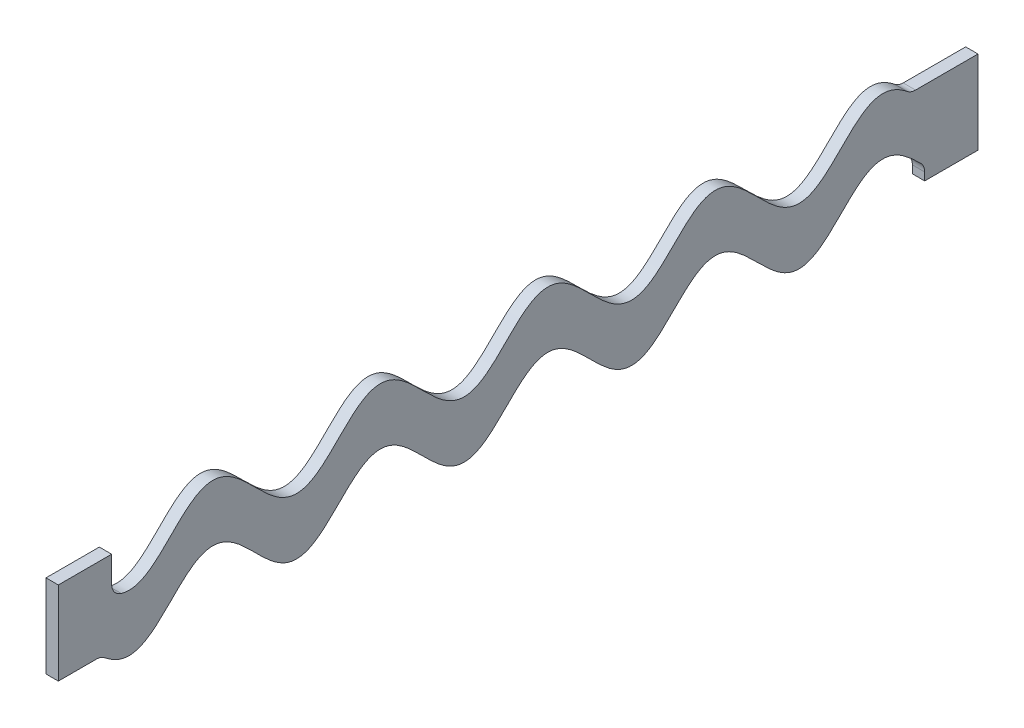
from build123d import *

# Parameters (mm, degrees)
SKETCH1_W           = 11.74
SKETCH1_H           = 79.375
BOSS_EXTRUDE1_DEPTH = 50.8
BOSS_EXTRUDE2_DEPTH = 11.74
BOSS_EXTRUDE3_REACH = 837.783
SKETCH6_W           = 11.74
SKETCH6_H           = 12.699929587
FILLET2_R           = 12.7


with BuildPart() as part:
    # Sketch1 → Boss-Extrude1 (new body)
    with BuildSketch(Plane.XY):
        with Locations((-5.87, 77.7875)):
            Rectangle(SKETCH1_W, SKETCH1_H)
    extrude(amount=BOSS_EXTRUDE1_DEPTH)

    # Sketch5 → Boss-Extrude2 (add)
    with BuildSketch(Plane.ZY.offset(11.74)):
        with BuildLine():
            Line((876.3, 117.475), (825.5, 117.475))
            Line((825.5, 117.475), (825.5, 84.629620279))
            add(Edge.make_bspline(
                [(50.800000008, 104.775070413), (51.355453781, 105.330524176), (52.470739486, 106.445803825), (54.365860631, 108.336036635), (56.616573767, 110.550459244), (59.045730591, 112.892625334), (61.427049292, 115.113600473), (63.902216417, 117.329610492), (66.410789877, 119.451736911), (69.053050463, 121.536346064), (71.826001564, 123.530133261), (75.346070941, 125.770952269), (79.301668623, 127.811126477), (83.703468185, 129.406198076), (88.524231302, 130.24115258), (92.937197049, 130.235262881), (97.7676673, 129.385824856), (103.00209859, 127.47578622), (109.779465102, 123.683414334), (117.601440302, 117.516681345), (125.997244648, 109.47364202), (135.195677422, 100.076514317), (143.591417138, 92.033403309), (151.413529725, 85.866822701), (158.190680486, 82.074211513), (163.425465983, 80.164565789), (168.255320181, 79.314444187), (172.669373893, 79.309762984), (177.488188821, 80.142546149), (182.729025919, 82.044450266), (188.063748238, 85.011131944), (193.461330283, 88.931686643), (198.549751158, 93.266779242), (203.407682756, 97.828676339), (206.848453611, 101.230691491), (209.883578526, 104.265888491), (212.097538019, 106.479409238), (214.39751836, 108.773755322), (217.860398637, 112.170969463), (221.982596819, 116.049452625), (227.084353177, 120.428873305), (232.510271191, 124.408143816), (237.942152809, 127.468963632), (243.301878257, 129.411354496), (248.129375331, 130.238527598), (252.534728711, 130.232696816), (257.369068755, 129.387469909), (261.848338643, 127.748907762), (265.941022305, 125.60724196), (271.571644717, 121.958454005), (278.040319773, 116.709085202), (285.685101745, 109.372673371), (294.693643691, 100.177334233), (303.015371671, 92.191742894), (310.807721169, 86.002047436), (317.644985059, 82.124404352), (323.00957917, 80.163040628), (327.844031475, 79.317234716), (332.249322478, 79.31172565), (337.076856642, 80.138707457), (342.436557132, 82.081227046), (347.868456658, 85.1419545), (353.294362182, 89.121289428), (358.396127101, 93.500665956), (362.518319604, 97.37917841), (365.981203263, 100.7763751), (368.842988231, 103.631173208), (371.128638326, 105.91896545), (373.990425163, 108.773753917), (377.453305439, 112.170968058), (381.575503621, 116.049451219), (386.677259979, 120.4288719), (392.103177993, 124.40814241), (397.535059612, 127.468962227), (402.894785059, 129.411353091), (407.722282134, 130.238526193), (412.127635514, 130.23269541), (416.961975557, 129.387468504), (421.441245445, 127.748906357), (425.533929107, 125.607240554), (431.164551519, 121.9584526), (437.633226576, 116.709083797), (445.278008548, 109.372671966), (454.286550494, 100.177332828), (462.608278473, 92.191741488), (470.400627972, 86.00204603), (477.237891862, 82.124402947), (482.602485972, 80.163039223), (487.436938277, 79.317233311), (491.842229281, 79.311724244), (496.669763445, 80.138706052), (502.029463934, 82.08122564), (507.461363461, 85.141953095), (512.887268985, 89.121288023), (517.989033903, 93.500664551), (522.111226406, 97.379177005), (525.574110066, 100.776373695), (528.435895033, 103.631171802), (530.721545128, 105.918964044), (533.583331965, 108.773752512), (537.046212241, 112.170966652), (541.168410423, 116.049449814), (546.270166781, 120.428870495), (551.696084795, 124.408141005), (557.127966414, 127.468960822), (562.487691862, 129.411351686), (567.315188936, 130.238524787), (571.720542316, 130.232694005), (576.554882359, 129.387467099), (581.034152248, 127.748904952), (585.126835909, 125.607239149), (590.757458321, 121.958451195), (597.226133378, 116.709082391), (604.87091535, 109.37267056), (613.879457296, 100.177331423), (622.201185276, 92.191740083), (629.993534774, 86.002044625), (636.830798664, 82.124401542), (642.195392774, 80.163037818), (647.029845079, 79.317231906), (651.435136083, 79.311722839), (656.262670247, 80.138704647), (661.622370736, 82.081224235), (667.054270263, 85.14195169), (672.480175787, 89.121286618), (677.581940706, 93.500663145), (681.704133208, 97.3791756), (685.167016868, 100.77637229), (687.466142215, 103.069928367), (688.8997198, 104.503062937), (691.823964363, 107.427440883), (694.40898947, 109.995830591), (698.005677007, 113.468910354), (701.979614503, 117.112401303), (706.492404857, 120.907591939), (711.124401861, 124.259804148), (715.966949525, 127.024545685), (721.078126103, 129.104123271), (726.423393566, 130.32939185), (733.021139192, 130.298984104), (739.96750141, 128.233444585), (746.347060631, 124.763168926), (752.864458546, 120.008215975), (759.165106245, 114.472772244), (765.692101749, 108.093410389), (772.628892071, 101.069699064), (779.141205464, 94.730218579), (785.409382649, 89.272087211), (791.020076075, 85.227333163), (795.824009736, 82.498303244), (800.906377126, 80.437186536), (806.23689434, 79.220467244), (811.736634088, 79.247728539), (817.055642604, 80.510425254), (821.119405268, 82.191017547), (823.547389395, 83.470662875), (824.987950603, 84.317723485), (825.5, 84.629620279)],
                knots=[0.009470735, 0.009470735, 0.009470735, 0.009470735, 0.009470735, 0.012708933, 0.015947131, 0.019185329, 0.022423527, 0.025661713, 0.028899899, 0.032138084, 0.03537627, 0.038848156, 0.042320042, 0.048507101, 0.052824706, 0.057142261, 0.061445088, 0.065747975, 0.071996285, 0.078918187, 0.091826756, 0.104735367, 0.117643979, 0.130552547, 0.13747445, 0.14372276, 0.148025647, 0.152328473, 0.156646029, 0.160963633, 0.167150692, 0.174094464, 0.180570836, 0.187047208, 0.193523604, 0.2, 0.2, 0.203332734, 0.206665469, 0.213330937, 0.219996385, 0.226661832, 0.234365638, 0.241031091, 0.245597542, 0.250041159, 0.254463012, 0.259101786, 0.265734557, 0.269601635, 0.273468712, 0.286734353, 0.3, 0.313265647, 0.326531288, 0.334265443, 0.340898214, 0.345536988, 0.349958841, 0.354402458, 0.358968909, 0.365634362, 0.373338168, 0.380003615, 0.386669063, 0.393334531, 0.396667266, 0.4, 0.403332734, 0.406665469, 0.413330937, 0.419996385, 0.426661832, 0.434365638, 0.441031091, 0.445597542, 0.450041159, 0.454463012, 0.459101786, 0.465734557, 0.469601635, 0.473468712, 0.486734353, 0.5, 0.513265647, 0.526531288, 0.534265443, 0.540898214, 0.545536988, 0.549958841, 0.554402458, 0.558968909, 0.565634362, 0.573338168, 0.580003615, 0.586669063, 0.593334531, 0.596667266, 0.6, 0.603332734, 0.606665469, 0.613330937, 0.619996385, 0.626661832, 0.634365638, 0.641031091, 0.645597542, 0.650041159, 0.654463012, 0.659101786, 0.665734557, 0.669601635, 0.673468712, 0.686734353, 0.7, 0.713265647, 0.726531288, 0.734265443, 0.740898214, 0.745536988, 0.749958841, 0.754402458, 0.758968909, 0.765634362, 0.773338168, 0.780003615, 0.786669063, 0.793334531, 0.796667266, 0.8, 0.8, 0.803242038, 0.806484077, 0.809726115, 0.812968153, 0.817424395, 0.821880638, 0.824701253, 0.827521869, 0.83184449, 0.836153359, 0.84176498, 0.846274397, 0.850783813, 0.857247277, 0.86371074, 0.870174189, 0.876637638, 0.881046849, 0.885456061, 0.88826188, 0.891067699, 0.895376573, 0.899685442, 0.902491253, 0.905297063, 0.906867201, 0.906867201, 0.906867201, 0.906867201, 0.906867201], degree=4))
            Line((50.800000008, 104.775070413), (50.8, 117.475))
            Line((50.8, 117.475), (0, 117.475))
            Line((0, 117.475), (0, 38.1))
            Line((0, 38.1), (50.8, 38.1))
            Line((50.8, 38.1), (50.800000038, 50.799657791))
            add(Edge.make_bspline(
                [(50.800000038, 50.799657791), (51.355453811, 51.355111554), (52.470739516, 52.470391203), (54.365860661, 54.360624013), (56.616573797, 56.575046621), (59.045730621, 58.917212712), (61.427049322, 61.138187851), (63.902216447, 63.35419787), (66.410789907, 65.476324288), (69.053050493, 67.560933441), (71.826001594, 69.554720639), (75.346070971, 71.795539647), (79.301668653, 73.835713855), (83.703468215, 75.430785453), (88.524231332, 76.265739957), (92.937197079, 76.259850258), (97.76766733, 75.410412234), (103.00209862, 73.500373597), (109.779465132, 69.708001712), (117.601440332, 63.541268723), (125.997244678, 55.498229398), (135.195677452, 46.101101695), (143.591417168, 38.057990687), (151.413529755, 31.891410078), (158.190680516, 28.098798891), (163.425466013, 26.189153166), (168.255320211, 25.339031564), (172.669373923, 25.334350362), (177.488188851, 26.167133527), (182.729025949, 28.069037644), (188.063748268, 31.035719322), (193.461330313, 34.956274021), (198.549751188, 39.29136662), (203.407682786, 43.853263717), (206.848453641, 47.255278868), (209.883578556, 50.290475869), (212.097538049, 52.503996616), (214.39751839, 54.7983427), (217.860398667, 58.195556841), (221.982596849, 62.074040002), (227.084353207, 66.453460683), (232.510271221, 70.432731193), (237.942152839, 73.49355101), (243.301878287, 75.435941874), (248.129375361, 76.263114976), (252.534728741, 76.257284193), (257.369068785, 75.412057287), (261.848338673, 73.77349514), (265.941022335, 71.631829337), (271.571644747, 67.983041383), (278.040319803, 62.73367258), (285.685101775, 55.397260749), (294.693643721, 46.201921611), (303.015371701, 38.216330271), (310.807721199, 32.026634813), (317.644985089, 28.14899173), (323.0095792, 26.187628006), (327.844031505, 25.341822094), (332.249322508, 25.336313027), (337.076856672, 26.163294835), (342.436557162, 28.105814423), (347.868456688, 31.166541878), (353.294362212, 35.145876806), (358.396127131, 39.525253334), (362.518319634, 43.403765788), (365.981203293, 46.800962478), (368.842988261, 49.655760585), (371.128638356, 51.943552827), (373.990425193, 54.798341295), (377.453305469, 58.195555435), (381.575503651, 62.074038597), (386.677260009, 66.453459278), (392.103178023, 70.432729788), (397.535059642, 73.493549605), (402.894785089, 75.435940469), (407.722282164, 76.26311357), (412.127635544, 76.257282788), (416.961975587, 75.412055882), (421.441245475, 73.773493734), (425.533929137, 71.631827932), (431.164551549, 67.983039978), (437.633226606, 62.733671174), (445.278008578, 55.397259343), (454.286550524, 46.201920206), (462.608278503, 38.216328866), (470.400628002, 32.026633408), (477.237891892, 28.148990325), (482.602486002, 26.187626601), (487.436938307, 25.341820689), (491.842229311, 25.336311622), (496.669763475, 26.16329343), (502.029463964, 28.105813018), (507.461363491, 31.166540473), (512.887269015, 35.145875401), (517.989033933, 39.525251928), (522.111226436, 43.403764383), (525.574110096, 46.800961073), (528.435895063, 49.65575918), (530.721545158, 51.943551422), (533.583331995, 54.798339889), (537.046212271, 58.19555403), (541.168410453, 62.074037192), (546.270166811, 66.453457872), (551.696084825, 70.432728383), (557.127966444, 73.493548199), (562.487691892, 75.435939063), (567.315188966, 76.263112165), (571.720542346, 76.257281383), (576.554882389, 75.412054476), (581.034152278, 73.773492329), (585.126835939, 71.631826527), (590.757458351, 67.983038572), (597.226133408, 62.733669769), (604.87091538, 55.397257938), (613.879457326, 46.2019188), (622.201185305, 38.216327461), (629.993534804, 32.026632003), (636.830798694, 28.14898892), (642.195392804, 26.187625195), (647.029845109, 25.341819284), (651.435136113, 25.336310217), (656.262670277, 26.163292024), (661.622370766, 28.105811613), (667.054270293, 31.166539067), (672.480175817, 35.145873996), (677.581940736, 39.525250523), (681.704133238, 43.403762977), (685.167016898, 46.800959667), (687.466142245, 49.094515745), (688.89971983, 50.527650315), (691.823964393, 53.45202826), (694.4089895, 56.020417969), (698.005677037, 59.493497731), (701.979614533, 63.136988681), (706.492404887, 66.932179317), (711.124401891, 70.284391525), (715.966949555, 73.049133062), (721.078126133, 75.128710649), (726.423393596, 76.353979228), (733.021139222, 76.323571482), (739.96750144, 74.258031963), (746.347060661, 70.787756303), (752.864458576, 66.032803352), (759.165106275, 60.497359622), (765.692101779, 54.117997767), (772.628892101, 47.094286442), (779.141205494, 40.754805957), (785.409382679, 35.296674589), (791.020076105, 31.25192054), (795.824009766, 28.522890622), (800.906377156, 26.461773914), (806.23689437, 25.245054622), (811.736634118, 25.272315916), (817.055642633, 26.535012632), (822.15890751, 28.645497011), (827.011816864, 31.443495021), (830.881620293, 34.268719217), (833.75266161, 36.624600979), (835.261924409, 37.923591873), (835.46562399, 38.1)],
                knots=[0.009470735, 0.009470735, 0.009470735, 0.009470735, 0.009470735, 0.012708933, 0.015947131, 0.019185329, 0.022423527, 0.025661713, 0.028899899, 0.032138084, 0.03537627, 0.038848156, 0.042320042, 0.048507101, 0.052824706, 0.057142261, 0.061445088, 0.065747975, 0.071996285, 0.078918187, 0.091826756, 0.104735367, 0.117643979, 0.130552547, 0.13747445, 0.14372276, 0.148025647, 0.152328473, 0.156646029, 0.160963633, 0.167150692, 0.174094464, 0.180570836, 0.187047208, 0.193523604, 0.2, 0.2, 0.203332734, 0.206665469, 0.213330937, 0.219996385, 0.226661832, 0.234365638, 0.241031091, 0.245597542, 0.250041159, 0.254463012, 0.259101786, 0.265734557, 0.269601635, 0.273468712, 0.286734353, 0.3, 0.313265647, 0.326531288, 0.334265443, 0.340898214, 0.345536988, 0.349958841, 0.354402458, 0.358968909, 0.365634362, 0.373338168, 0.380003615, 0.386669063, 0.393334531, 0.396667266, 0.4, 0.403332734, 0.406665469, 0.413330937, 0.419996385, 0.426661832, 0.434365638, 0.441031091, 0.445597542, 0.450041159, 0.454463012, 0.459101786, 0.465734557, 0.469601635, 0.473468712, 0.486734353, 0.5, 0.513265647, 0.526531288, 0.534265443, 0.540898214, 0.545536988, 0.549958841, 0.554402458, 0.558968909, 0.565634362, 0.573338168, 0.580003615, 0.586669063, 0.593334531, 0.596667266, 0.6, 0.603332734, 0.606665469, 0.613330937, 0.619996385, 0.626661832, 0.634365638, 0.641031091, 0.645597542, 0.650041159, 0.654463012, 0.659101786, 0.665734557, 0.669601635, 0.673468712, 0.686734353, 0.7, 0.713265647, 0.726531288, 0.734265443, 0.740898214, 0.745536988, 0.749958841, 0.754402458, 0.758968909, 0.765634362, 0.773338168, 0.780003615, 0.786669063, 0.793334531, 0.796667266, 0.8, 0.8, 0.803242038, 0.806484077, 0.809726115, 0.812968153, 0.817424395, 0.821880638, 0.824701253, 0.827521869, 0.83184449, 0.836153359, 0.84176498, 0.846274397, 0.850783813, 0.857247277, 0.86371074, 0.870174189, 0.876637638, 0.881046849, 0.885456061, 0.88826188, 0.891067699, 0.895376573, 0.899685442, 0.902491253, 0.905297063, 0.90980648, 0.914315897, 0.915021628, 0.915021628, 0.915021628, 0.915021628, 0.915021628], degree=4))
            Line((835.46562399, 38.1), (876.3, 38.1))
            Line((876.3, 38.1), (876.3, 117.475))
        make_face()
    extrude(amount=-BOSS_EXTRUDE2_DEPTH)

    # Sketch6 → Boss-Extrude3 (add, up to next)
    with BuildSketch(Plane.XY.offset(50.8), mode=Mode.PRIVATE) as boss_extrude3_sk1:
        with Locations((-5.87, 111.125035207)):
            Rectangle(SKETCH6_W, SKETCH6_H)
    boss_extrude3_tool1 = extrude(boss_extrude3_sk1.sketch, amount=BOSS_EXTRUDE3_REACH, mode=Mode.PRIVATE) - part.part
    add(boss_extrude3_tool1.solids().sort_by_distance((-5.87, 111.125035, 50.8))[0])

    # Fillet2
    fillet2_edges = [part.edges().sort_by_distance(p)[0] for p in [
        (-5.87, 84.629620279, 825.5),
        (-5.87, 38.1, 835.46562399),
        (-5.87, 117.475, 64.09916794),
        (-5.87, 50.799657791, 50.800000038),
    ]]
    fillet(fillet2_edges, radius=FILLET2_R)


solid = part.part
